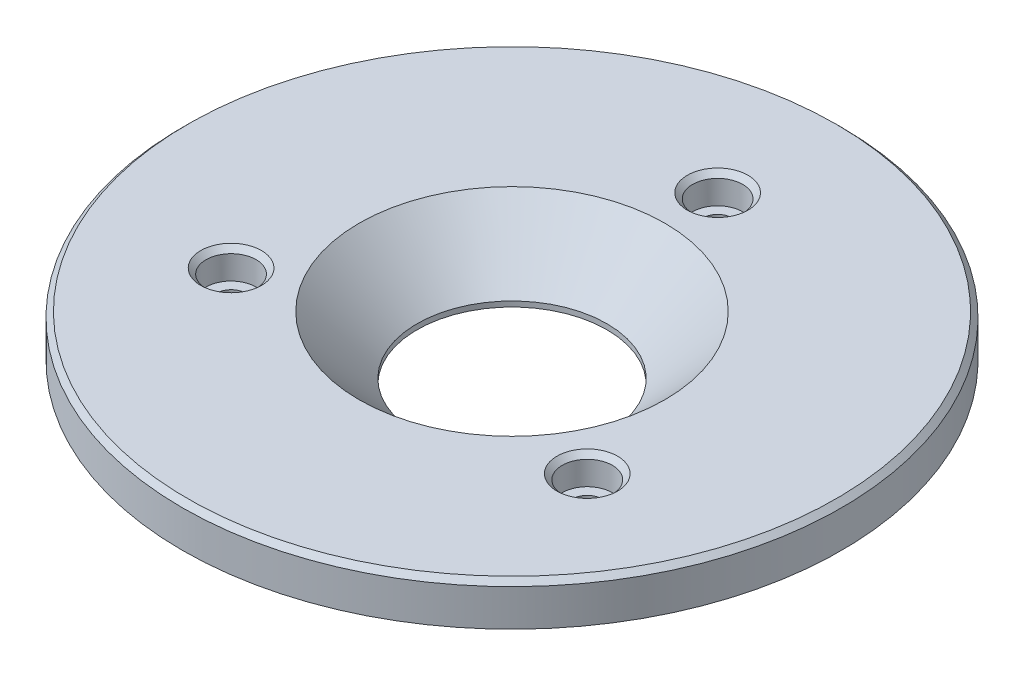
ISO-10303-21;
HEADER;
FILE_DESCRIPTION(('STEP AP214'),'2;1');
FILE_NAME('part.step','',(''),(''),'','','');
FILE_SCHEMA(('AUTOMOTIVE_DESIGN { 1 0 10303 214 1 1 1 1 }'));
ENDSEC;
DATA;
#1=APPLICATION_CONTEXT('core data for automotive mechanical design processes');
#2=APPLICATION_PROTOCOL_DEFINITION('international standard','automotive_design',2000,#1);
#3=PRODUCT_CONTEXT('',#1,'mechanical');
#4=PRODUCT('Part','Part','',(#3));
#5=PRODUCT_RELATED_PRODUCT_CATEGORY('part','',(#4));
#6=PRODUCT_DEFINITION_FORMATION('','',#4);
#7=PRODUCT_DEFINITION_CONTEXT('part definition',#1,'design');
#8=PRODUCT_DEFINITION('design','',#6,#7);
#9=PRODUCT_DEFINITION_SHAPE('','',#8);
#10=(LENGTH_UNIT() NAMED_UNIT(*) SI_UNIT(.MILLI.,.METRE.));
#11=(NAMED_UNIT(*) PLANE_ANGLE_UNIT() SI_UNIT($,.RADIAN.));
#12=(NAMED_UNIT(*) SI_UNIT($,.STERADIAN.) SOLID_ANGLE_UNIT());
#13=UNCERTAINTY_MEASURE_WITH_UNIT(LENGTH_MEASURE(1.E-05),#10,'distance_accuracy_value','');
#14=(GEOMETRIC_REPRESENTATION_CONTEXT(3) GLOBAL_UNCERTAINTY_ASSIGNED_CONTEXT((#13)) GLOBAL_UNIT_ASSIGNED_CONTEXT((#10,
#11,#12)) REPRESENTATION_CONTEXT('',''));
#15=CARTESIAN_POINT('',(0.,0.,0.));
#16=DIRECTION('',(0.,0.,1.));
#17=DIRECTION('',(1.,0.,0.));
#18=AXIS2_PLACEMENT_3D('',#15,#16,#17);
#19=CARTESIAN_POINT('',(-29.,12.,0.));
#20=DIRECTION('',(0.,-1.,0.));
#21=DIRECTION('',(0.,0.,-1.));
#22=AXIS2_PLACEMENT_3D('',#19,#20,#21);
#23=PLANE('',#22);
#24=CARTESIAN_POINT('',(33.7749907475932,12.,19.5));
#25=DIRECTION('',(0.,-1.,0.));
#26=DIRECTION('',(0.,0.,-1.));
#27=AXIS2_PLACEMENT_3D('',#24,#25,#26);
#28=CIRCLE('',#27,5.75);
#29=CARTESIAN_POINT('',(33.7749907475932,12.,13.75));
#30=VERTEX_POINT('',#29);
#31=EDGE_CURVE('E25',#30,#30,#28,.T.);
#32=ORIENTED_EDGE('',*,*,#31,.T.);
#33=EDGE_LOOP('',(#32));
#34=FACE_BOUND('',#33,.T.);
#35=CARTESIAN_POINT('',(0.,12.,-39.));
#36=DIRECTION('',(0.,-1.,0.));
#37=DIRECTION('',(0.,0.,-1.));
#38=AXIS2_PLACEMENT_3D('',#35,#36,#37);
#39=CIRCLE('',#38,5.75);
#40=CARTESIAN_POINT('',(0.,12.,-44.75));
#41=VERTEX_POINT('',#40);
#42=EDGE_CURVE('E29',#41,#41,#39,.T.);
#43=ORIENTED_EDGE('',*,*,#42,.T.);
#44=EDGE_LOOP('',(#43));
#45=FACE_BOUND('',#44,.T.);
#46=CARTESIAN_POINT('',(-33.7749907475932,12.,19.5));
#47=DIRECTION('',(0.,-1.,0.));
#48=DIRECTION('',(0.,0.,-1.));
#49=AXIS2_PLACEMENT_3D('',#46,#47,#48);
#50=CIRCLE('',#49,5.75);
#51=CARTESIAN_POINT('',(-33.7749907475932,12.,13.75));
#52=VERTEX_POINT('',#51);
#53=EDGE_CURVE('E34',#52,#52,#50,.T.);
#54=ORIENTED_EDGE('',*,*,#53,.T.);
#55=EDGE_LOOP('',(#54));
#56=FACE_BOUND('',#55,.T.);
#57=CARTESIAN_POINT('',(0.,12.,0.));
#58=DIRECTION('',(0.,-1.,0.));
#59=DIRECTION('',(0.,0.,-1.));
#60=AXIS2_PLACEMENT_3D('',#57,#58,#59);
#61=CIRCLE('',#60,61.5);
#62=CARTESIAN_POINT('',(0.,12.,-61.5));
#63=VERTEX_POINT('',#62);
#64=EDGE_CURVE('E58',#63,#63,#61,.F.);
#65=ORIENTED_EDGE('',*,*,#64,.T.);
#66=EDGE_LOOP('',(#65));
#67=FACE_BOUND('',#66,.T.);
#68=CARTESIAN_POINT('',(0.,12.,0.));
#69=DIRECTION('',(0.,-1.,0.));
#70=DIRECTION('',(0.,0.,-1.));
#71=AXIS2_PLACEMENT_3D('',#68,#69,#70);
#72=CIRCLE('',#71,29.);
#73=CARTESIAN_POINT('',(0.,12.,-29.));
#74=VERTEX_POINT('',#73);
#75=EDGE_CURVE('E70',#74,#74,#72,.T.);
#76=ORIENTED_EDGE('',*,*,#75,.T.);
#77=EDGE_LOOP('',(#76));
#78=FACE_BOUND('',#77,.T.);
#79=ADVANCED_FACE('F14',(#34,#45,#56,#67,#78),#23,.F.);
#80=CARTESIAN_POINT('',(0.,1.,0.));
#81=DIRECTION('',(0.,1.,0.));
#82=DIRECTION('',(0.,0.,1.));
#83=AXIS2_PLACEMENT_3D('',#80,#81,#82);
#84=CONICAL_SURFACE('',#83,18.,0.78539816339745);
#85=ORIENTED_EDGE('',*,*,#75,.F.);
#86=EDGE_LOOP('',(#85));
#87=FACE_BOUND('',#86,.T.);
#88=CARTESIAN_POINT('',(0.,1.,0.));
#89=DIRECTION('',(0.,-1.,0.));
#90=DIRECTION('',(0.,0.,-1.));
#91=AXIS2_PLACEMENT_3D('',#88,#89,#90);
#92=CIRCLE('',#91,18.);
#93=CARTESIAN_POINT('',(0.,1.,-18.));
#94=VERTEX_POINT('',#93);
#95=EDGE_CURVE('E83',#94,#94,#92,.T.);
#96=ORIENTED_EDGE('',*,*,#95,.T.);
#97=EDGE_LOOP('',(#96));
#98=FACE_BOUND('',#97,.T.);
#99=ADVANCED_FACE('F123',(#87,#98),#84,.F.);
#100=CARTESIAN_POINT('',(0.,0.,0.));
#101=DIRECTION('',(0.,-1.,0.));
#102=DIRECTION('',(0.,0.,-1.));
#103=AXIS2_PLACEMENT_3D('',#100,#101,#102);
#104=CYLINDRICAL_SURFACE('',#103,18.);
#105=ORIENTED_EDGE('',*,*,#95,.F.);
#106=EDGE_LOOP('',(#105));
#107=FACE_BOUND('',#106,.T.);
#108=CARTESIAN_POINT('',(0.,0.,0.));
#109=DIRECTION('',(0.,-1.,0.));
#110=DIRECTION('',(0.,0.,-1.));
#111=AXIS2_PLACEMENT_3D('',#108,#109,#110);
#112=CIRCLE('',#111,18.);
#113=CARTESIAN_POINT('',(0.,0.,-18.));
#114=VERTEX_POINT('',#113);
#115=EDGE_CURVE('E86',#114,#114,#112,.T.);
#116=ORIENTED_EDGE('',*,*,#115,.T.);
#117=EDGE_LOOP('',(#116));
#118=FACE_BOUND('',#117,.T.);
#119=ADVANCED_FACE('F130',(#107,#118),#104,.F.);
#120=CARTESIAN_POINT('',(-18.,0.,0.));
#121=DIRECTION('',(0.,1.,0.));
#122=DIRECTION('',(0.,0.,1.));
#123=AXIS2_PLACEMENT_3D('',#120,#121,#122);
#124=PLANE('',#123);
#125=CARTESIAN_POINT('',(-33.7749907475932,0.,19.5));
#126=DIRECTION('',(0.,1.,0.));
#127=DIRECTION('',(0.,0.,1.));
#128=AXIS2_PLACEMENT_3D('',#125,#126,#127);
#129=CIRCLE('',#128,3.75);
#130=CARTESIAN_POINT('',(-33.7749907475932,0.,23.25));
#131=VERTEX_POINT('',#130);
#132=EDGE_CURVE('E49',#131,#131,#129,.T.);
#133=ORIENTED_EDGE('',*,*,#132,.T.);
#134=EDGE_LOOP('',(#133));
#135=FACE_BOUND('',#134,.T.);
#136=CARTESIAN_POINT('',(33.7749907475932,0.,19.5));
#137=DIRECTION('',(0.,1.,0.));
#138=DIRECTION('',(0.,0.,1.));
#139=AXIS2_PLACEMENT_3D('',#136,#137,#138);
#140=CIRCLE('',#139,3.75);
#141=CARTESIAN_POINT('',(33.7749907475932,0.,23.25));
#142=VERTEX_POINT('',#141);
#143=EDGE_CURVE('E52',#142,#142,#140,.T.);
#144=ORIENTED_EDGE('',*,*,#143,.T.);
#145=EDGE_LOOP('',(#144));
#146=FACE_BOUND('',#145,.T.);
#147=CARTESIAN_POINT('',(0.,0.,-39.));
#148=DIRECTION('',(0.,1.,0.));
#149=DIRECTION('',(0.,0.,1.));
#150=AXIS2_PLACEMENT_3D('',#147,#148,#149);
#151=CIRCLE('',#150,3.75);
#152=CARTESIAN_POINT('',(0.,0.,-35.25));
#153=VERTEX_POINT('',#152);
#154=EDGE_CURVE('E55',#153,#153,#151,.T.);
#155=ORIENTED_EDGE('',*,*,#154,.T.);
#156=EDGE_LOOP('',(#155));
#157=FACE_BOUND('',#156,.T.);
#158=CARTESIAN_POINT('',(0.,0.,0.));
#159=DIRECTION('',(0.,1.,0.));
#160=DIRECTION('',(0.,0.,1.));
#161=AXIS2_PLACEMENT_3D('',#158,#159,#160);
#162=CIRCLE('',#161,44.);
#163=CARTESIAN_POINT('',(0.,0.,44.));
#164=VERTEX_POINT('',#163);
#165=EDGE_CURVE('E67',#164,#164,#162,.F.);
#166=ORIENTED_EDGE('',*,*,#165,.T.);
#167=EDGE_LOOP('',(#166));
#168=FACE_BOUND('',#167,.T.);
#169=ORIENTED_EDGE('',*,*,#115,.F.);
#170=EDGE_LOOP('',(#169));
#171=FACE_BOUND('',#170,.T.);
#172=ADVANCED_FACE('F181',(#135,#146,#157,#168,#171),#124,.F.);
#173=CARTESIAN_POINT('',(0.,0.,0.));
#174=DIRECTION('',(0.,-1.,0.));
#175=DIRECTION('',(0.,0.,-1.));
#176=AXIS2_PLACEMENT_3D('',#173,#174,#175);
#177=CYLINDRICAL_SURFACE('',#176,45.);
#178=CARTESIAN_POINT('',(0.,0.999999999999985,0.));
#179=DIRECTION('',(0.,1.,0.));
#180=DIRECTION('',(0.,0.,1.));
#181=AXIS2_PLACEMENT_3D('',#178,#179,#180);
#182=CIRCLE('',#181,45.);
#183=CARTESIAN_POINT('',(0.,0.999999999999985,45.));
#184=VERTEX_POINT('',#183);
#185=EDGE_CURVE('E64',#184,#184,#182,.T.);
#186=ORIENTED_EDGE('',*,*,#185,.T.);
#187=EDGE_LOOP('',(#186));
#188=FACE_BOUND('',#187,.T.);
#189=CARTESIAN_POINT('',(0.,4.,0.));
#190=DIRECTION('',(0.,-1.,0.));
#191=DIRECTION('',(0.,0.,-1.));
#192=AXIS2_PLACEMENT_3D('',#189,#190,#191);
#193=CIRCLE('',#192,45.);
#194=CARTESIAN_POINT('',(0.,4.,-45.));
#195=VERTEX_POINT('',#194);
#196=EDGE_CURVE('E89',#195,#195,#193,.T.);
#197=ORIENTED_EDGE('',*,*,#196,.T.);
#198=EDGE_LOOP('',(#197));
#199=FACE_BOUND('',#198,.T.);
#200=ADVANCED_FACE('F185',(#188,#199),#177,.T.);
#201=CARTESIAN_POINT('',(-45.,4.,0.));
#202=DIRECTION('',(0.,1.,0.));
#203=DIRECTION('',(0.,0.,1.));
#204=AXIS2_PLACEMENT_3D('',#201,#202,#203);
#205=PLANE('',#204);
#206=ORIENTED_EDGE('',*,*,#196,.F.);
#207=EDGE_LOOP('',(#206));
#208=FACE_BOUND('',#207,.T.);
#209=CARTESIAN_POINT('',(0.,4.,0.));
#210=DIRECTION('',(0.,-1.,0.));
#211=DIRECTION('',(0.,0.,-1.));
#212=AXIS2_PLACEMENT_3D('',#209,#210,#211);
#213=CIRCLE('',#212,62.5);
#214=CARTESIAN_POINT('',(0.,4.,-62.5));
#215=VERTEX_POINT('',#214);
#216=EDGE_CURVE('E92',#215,#215,#213,.T.);
#217=ORIENTED_EDGE('',*,*,#216,.T.);
#218=EDGE_LOOP('',(#217));
#219=FACE_BOUND('',#218,.T.);
#220=ADVANCED_FACE('F192',(#208,#219),#205,.F.);
#221=CARTESIAN_POINT('',(0.,0.,0.));
#222=DIRECTION('',(0.,-1.,0.));
#223=DIRECTION('',(0.,0.,-1.));
#224=AXIS2_PLACEMENT_3D('',#221,#222,#223);
#225=CYLINDRICAL_SURFACE('',#224,62.5);
#226=CARTESIAN_POINT('',(0.,11.,0.));
#227=DIRECTION('',(0.,-1.,0.));
#228=DIRECTION('',(0.,0.,-1.));
#229=AXIS2_PLACEMENT_3D('',#226,#227,#228);
#230=CIRCLE('',#229,62.5);
#231=CARTESIAN_POINT('',(0.,11.,-62.5));
#232=VERTEX_POINT('',#231);
#233=EDGE_CURVE('E61',#232,#232,#230,.T.);
#234=ORIENTED_EDGE('',*,*,#233,.T.);
#235=EDGE_LOOP('',(#234));
#236=FACE_BOUND('',#235,.T.);
#237=ORIENTED_EDGE('',*,*,#216,.F.);
#238=EDGE_LOOP('',(#237));
#239=FACE_BOUND('',#238,.T.);
#240=ADVANCED_FACE('F199',(#236,#239),#225,.T.);
#241=CARTESIAN_POINT('',(33.7749907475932,6.5,19.5));
#242=DIRECTION('',(0.,1.,0.));
#243=DIRECTION('',(0.,0.,1.));
#244=AXIS2_PLACEMENT_3D('',#241,#242,#243);
#245=CYLINDRICAL_SURFACE('',#244,4.75);
#246=CARTESIAN_POINT('',(33.7749907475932,11.,19.5));
#247=DIRECTION('',(0.,-1.,0.));
#248=DIRECTION('',(0.,0.,-1.));
#249=AXIS2_PLACEMENT_3D('',#246,#247,#248);
#250=CIRCLE('',#249,4.75);
#251=CARTESIAN_POINT('',(33.7749907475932,11.,14.75));
#252=VERTEX_POINT('',#251);
#253=EDGE_CURVE('E37',#252,#252,#250,.F.);
#254=ORIENTED_EDGE('',*,*,#253,.T.);
#255=EDGE_LOOP('',(#254));
#256=FACE_BOUND('',#255,.T.);
#257=CARTESIAN_POINT('',(33.7749907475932,6.5,19.5));
#258=DIRECTION('',(0.,1.,0.));
#259=DIRECTION('',(0.,0.,-1.));
#260=AXIS2_PLACEMENT_3D('',#257,#258,#259);
#261=CIRCLE('',#260,4.75);
#262=CARTESIAN_POINT('',(33.7749907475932,6.5,14.75));
#263=VERTEX_POINT('',#262);
#264=EDGE_CURVE('E74',#263,#263,#261,.T.);
#265=ORIENTED_EDGE('',*,*,#264,.F.);
#266=EDGE_LOOP('',(#265));
#267=FACE_BOUND('',#266,.T.);
#268=ADVANCED_FACE('F203',(#256,#267),#245,.F.);
#269=CARTESIAN_POINT('',(33.7749907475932,6.5,19.5));
#270=DIRECTION('',(0.,-1.,0.));
#271=DIRECTION('',(0.,0.,-1.));
#272=AXIS2_PLACEMENT_3D('',#269,#270,#271);
#273=PLANE('',#272);
#274=CARTESIAN_POINT('',(33.7749907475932,6.5,19.5));
#275=DIRECTION('',(0.,-1.,0.));
#276=DIRECTION('',(0.,0.,-1.));
#277=AXIS2_PLACEMENT_3D('',#274,#275,#276);
#278=CIRCLE('',#277,2.75);
#279=CARTESIAN_POINT('',(33.7749907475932,6.5,16.75));
#280=VERTEX_POINT('',#279);
#281=EDGE_CURVE('E71',#280,#280,#278,.T.);
#282=ORIENTED_EDGE('',*,*,#281,.T.);
#283=EDGE_LOOP('',(#282));
#284=FACE_BOUND('',#283,.T.);
#285=ORIENTED_EDGE('',*,*,#264,.T.);
#286=EDGE_LOOP('',(#285));
#287=FACE_BOUND('',#286,.T.);
#288=ADVANCED_FACE('F207',(#284,#287),#273,.F.);
#289=CARTESIAN_POINT('',(-33.7749907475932,6.5,19.5));
#290=DIRECTION('',(0.,1.,0.));
#291=DIRECTION('',(0.,0.,1.));
#292=AXIS2_PLACEMENT_3D('',#289,#290,#291);
#293=CYLINDRICAL_SURFACE('',#292,4.75);
#294=CARTESIAN_POINT('',(-33.7749907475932,11.,19.5));
#295=DIRECTION('',(0.,-1.,0.));
#296=DIRECTION('',(0.,0.,-1.));
#297=AXIS2_PLACEMENT_3D('',#294,#295,#296);
#298=CIRCLE('',#297,4.75);
#299=CARTESIAN_POINT('',(-33.7749907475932,11.,14.75));
#300=VERTEX_POINT('',#299);
#301=EDGE_CURVE('E9',#300,#300,#298,.F.);
#302=ORIENTED_EDGE('',*,*,#301,.T.);
#303=EDGE_LOOP('',(#302));
#304=FACE_BOUND('',#303,.T.);
#305=CARTESIAN_POINT('',(-33.7749907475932,6.5,19.5));
#306=DIRECTION('',(0.,1.,0.));
#307=DIRECTION('',(0.,0.,1.));
#308=AXIS2_PLACEMENT_3D('',#305,#306,#307);
#309=CIRCLE('',#308,4.75);
#310=CARTESIAN_POINT('',(-33.7749907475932,6.5,24.25));
#311=VERTEX_POINT('',#310);
#312=EDGE_CURVE('E98',#311,#311,#309,.T.);
#313=ORIENTED_EDGE('',*,*,#312,.F.);
#314=EDGE_LOOP('',(#313));
#315=FACE_BOUND('',#314,.T.);
#316=ADVANCED_FACE('F119',(#304,#315),#293,.F.);
#317=CARTESIAN_POINT('',(-33.7749907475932,6.5,19.5));
#318=DIRECTION('',(0.,1.,0.));
#319=DIRECTION('',(0.,0.,1.));
#320=AXIS2_PLACEMENT_3D('',#317,#318,#319);
#321=PLANE('',#320);
#322=CARTESIAN_POINT('',(-33.7749907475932,6.5,19.5));
#323=DIRECTION('',(0.,1.,0.));
#324=DIRECTION('',(0.,0.,1.));
#325=AXIS2_PLACEMENT_3D('',#322,#323,#324);
#326=CIRCLE('',#325,2.75);
#327=CARTESIAN_POINT('',(-33.7749907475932,6.5,22.25));
#328=VERTEX_POINT('',#327);
#329=EDGE_CURVE('E75',#328,#328,#326,.T.);
#330=ORIENTED_EDGE('',*,*,#329,.F.);
#331=EDGE_LOOP('',(#330));
#332=FACE_BOUND('',#331,.T.);
#333=ORIENTED_EDGE('',*,*,#312,.T.);
#334=EDGE_LOOP('',(#333));
#335=FACE_BOUND('',#334,.T.);
#336=ADVANCED_FACE('F108',(#332,#335),#321,.T.);
#337=CARTESIAN_POINT('',(0.,6.5,-39.));
#338=DIRECTION('',(0.,1.,0.));
#339=DIRECTION('',(0.,0.,1.));
#340=AXIS2_PLACEMENT_3D('',#337,#338,#339);
#341=CYLINDRICAL_SURFACE('',#340,4.75);
#342=CARTESIAN_POINT('',(0.,11.,-39.));
#343=DIRECTION('',(0.,-1.,0.));
#344=DIRECTION('',(0.,0.,-1.));
#345=AXIS2_PLACEMENT_3D('',#342,#343,#344);
#346=CIRCLE('',#345,4.75);
#347=CARTESIAN_POINT('',(0.,11.,-43.75));
#348=VERTEX_POINT('',#347);
#349=EDGE_CURVE('E21',#348,#348,#346,.F.);
#350=ORIENTED_EDGE('',*,*,#349,.T.);
#351=EDGE_LOOP('',(#350));
#352=FACE_BOUND('',#351,.T.);
#353=CARTESIAN_POINT('',(0.,6.5,-39.));
#354=DIRECTION('',(0.,1.,0.));
#355=DIRECTION('',(0.,0.,1.));
#356=AXIS2_PLACEMENT_3D('',#353,#354,#355);
#357=CIRCLE('',#356,4.75);
#358=CARTESIAN_POINT('',(0.,6.5,-34.25));
#359=VERTEX_POINT('',#358);
#360=EDGE_CURVE('E95',#359,#359,#357,.T.);
#361=ORIENTED_EDGE('',*,*,#360,.F.);
#362=EDGE_LOOP('',(#361));
#363=FACE_BOUND('',#362,.T.);
#364=ADVANCED_FACE('F106',(#352,#363),#341,.F.);
#365=CARTESIAN_POINT('',(0.,6.5,-39.));
#366=DIRECTION('',(0.,1.,0.));
#367=DIRECTION('',(0.,0.,1.));
#368=AXIS2_PLACEMENT_3D('',#365,#366,#367);
#369=PLANE('',#368);
#370=CARTESIAN_POINT('',(0.,6.5,-39.));
#371=DIRECTION('',(0.,1.,0.));
#372=DIRECTION('',(0.,0.,1.));
#373=AXIS2_PLACEMENT_3D('',#370,#371,#372);
#374=CIRCLE('',#373,2.75);
#375=CARTESIAN_POINT('',(0.,6.5,-36.25));
#376=VERTEX_POINT('',#375);
#377=EDGE_CURVE('E78',#376,#376,#374,.T.);
#378=ORIENTED_EDGE('',*,*,#377,.F.);
#379=EDGE_LOOP('',(#378));
#380=FACE_BOUND('',#379,.T.);
#381=ORIENTED_EDGE('',*,*,#360,.T.);
#382=EDGE_LOOP('',(#381));
#383=FACE_BOUND('',#382,.T.);
#384=ADVANCED_FACE('F104',(#380,#383),#369,.T.);
#385=CARTESIAN_POINT('',(0.,0.,-39.));
#386=DIRECTION('',(0.,1.,0.));
#387=DIRECTION('',(0.,0.,1.));
#388=AXIS2_PLACEMENT_3D('',#385,#386,#387);
#389=CYLINDRICAL_SURFACE('',#388,2.75);
#390=CARTESIAN_POINT('',(0.,1.00000000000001,-39.));
#391=DIRECTION('',(0.,1.,0.));
#392=DIRECTION('',(0.,0.,1.));
#393=AXIS2_PLACEMENT_3D('',#390,#391,#392);
#394=CIRCLE('',#393,2.75);
#395=CARTESIAN_POINT('',(0.,1.00000000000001,-36.25));
#396=VERTEX_POINT('',#395);
#397=EDGE_CURVE('E40',#396,#396,#394,.F.);
#398=ORIENTED_EDGE('',*,*,#397,.T.);
#399=EDGE_LOOP('',(#398));
#400=FACE_BOUND('',#399,.T.);
#401=ORIENTED_EDGE('',*,*,#377,.T.);
#402=EDGE_LOOP('',(#401));
#403=FACE_BOUND('',#402,.T.);
#404=ADVANCED_FACE('F116',(#400,#403),#389,.F.);
#405=CARTESIAN_POINT('',(-33.7749907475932,0.,19.5));
#406=DIRECTION('',(0.,1.,0.));
#407=DIRECTION('',(0.,0.,1.));
#408=AXIS2_PLACEMENT_3D('',#405,#406,#407);
#409=CYLINDRICAL_SURFACE('',#408,2.75);
#410=CARTESIAN_POINT('',(-33.7749907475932,0.999999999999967,19.5));
#411=DIRECTION('',(0.,1.,0.));
#412=DIRECTION('',(0.,0.,1.));
#413=AXIS2_PLACEMENT_3D('',#410,#411,#412);
#414=CIRCLE('',#413,2.75);
#415=CARTESIAN_POINT('',(-33.7749907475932,0.999999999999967,22.25));
#416=VERTEX_POINT('',#415);
#417=EDGE_CURVE('E46',#416,#416,#414,.F.);
#418=ORIENTED_EDGE('',*,*,#417,.T.);
#419=EDGE_LOOP('',(#418));
#420=FACE_BOUND('',#419,.T.);
#421=ORIENTED_EDGE('',*,*,#329,.T.);
#422=EDGE_LOOP('',(#421));
#423=FACE_BOUND('',#422,.T.);
#424=ADVANCED_FACE('F338',(#420,#423),#409,.F.);
#425=CARTESIAN_POINT('',(33.7749907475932,0.,19.5));
#426=DIRECTION('',(0.,1.,0.));
#427=DIRECTION('',(0.,0.,1.));
#428=AXIS2_PLACEMENT_3D('',#425,#426,#427);
#429=CYLINDRICAL_SURFACE('',#428,2.75);
#430=CARTESIAN_POINT('',(33.7749907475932,1.,19.5));
#431=DIRECTION('',(0.,1.,0.));
#432=DIRECTION('',(0.,0.,1.));
#433=AXIS2_PLACEMENT_3D('',#430,#431,#432);
#434=CIRCLE('',#433,2.75);
#435=CARTESIAN_POINT('',(33.7749907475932,1.,22.25));
#436=VERTEX_POINT('',#435);
#437=EDGE_CURVE('E43',#436,#436,#434,.F.);
#438=ORIENTED_EDGE('',*,*,#437,.T.);
#439=EDGE_LOOP('',(#438));
#440=FACE_BOUND('',#439,.T.);
#441=ORIENTED_EDGE('',*,*,#281,.F.);
#442=EDGE_LOOP('',(#441));
#443=FACE_BOUND('',#442,.T.);
#444=ADVANCED_FACE('F140',(#440,#443),#429,.F.);
#445=CARTESIAN_POINT('',(0.,0.,0.));
#446=DIRECTION('',(0.,1.,0.));
#447=DIRECTION('',(0.,0.,1.));
#448=AXIS2_PLACEMENT_3D('',#445,#446,#447);
#449=CONICAL_SURFACE('',#448,44.,0.785398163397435);
#450=ORIENTED_EDGE('',*,*,#185,.F.);
#451=EDGE_LOOP('',(#450));
#452=FACE_BOUND('',#451,.T.);
#453=ORIENTED_EDGE('',*,*,#165,.F.);
#454=EDGE_LOOP('',(#453));
#455=FACE_BOUND('',#454,.T.);
#456=ADVANCED_FACE('F136',(#452,#455),#449,.T.);
#457=CARTESIAN_POINT('',(0.,11.,0.));
#458=DIRECTION('',(0.,-1.,0.));
#459=DIRECTION('',(0.,0.,-1.));
#460=AXIS2_PLACEMENT_3D('',#457,#458,#459);
#461=CONICAL_SURFACE('',#460,62.5,0.785398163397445);
#462=ORIENTED_EDGE('',*,*,#64,.F.);
#463=EDGE_LOOP('',(#462));
#464=FACE_BOUND('',#463,.T.);
#465=ORIENTED_EDGE('',*,*,#233,.F.);
#466=EDGE_LOOP('',(#465));
#467=FACE_BOUND('',#466,.T.);
#468=ADVANCED_FACE('F139',(#464,#467),#461,.T.);
#469=CARTESIAN_POINT('',(-33.7749907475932,0.,19.5));
#470=DIRECTION('',(0.,-1.,0.));
#471=DIRECTION('',(0.,0.,-1.));
#472=AXIS2_PLACEMENT_3D('',#469,#470,#471);
#473=CONICAL_SURFACE('',#472,3.75,0.785398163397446);
#474=ORIENTED_EDGE('',*,*,#417,.F.);
#475=EDGE_LOOP('',(#474));
#476=FACE_BOUND('',#475,.T.);
#477=ORIENTED_EDGE('',*,*,#132,.F.);
#478=EDGE_LOOP('',(#477));
#479=FACE_BOUND('',#478,.T.);
#480=ADVANCED_FACE('F144',(#476,#479),#473,.F.);
#481=CARTESIAN_POINT('',(33.7749907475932,0.,19.5));
#482=DIRECTION('',(0.,-1.,0.));
#483=DIRECTION('',(0.,0.,-1.));
#484=AXIS2_PLACEMENT_3D('',#481,#482,#483);
#485=CONICAL_SURFACE('',#484,3.75,0.785398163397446);
#486=ORIENTED_EDGE('',*,*,#437,.F.);
#487=EDGE_LOOP('',(#486));
#488=FACE_BOUND('',#487,.T.);
#489=ORIENTED_EDGE('',*,*,#143,.F.);
#490=EDGE_LOOP('',(#489));
#491=FACE_BOUND('',#490,.T.);
#492=ADVANCED_FACE('F148',(#488,#491),#485,.F.);
#493=CARTESIAN_POINT('',(0.,0.,-39.));
#494=DIRECTION('',(0.,-1.,0.));
#495=DIRECTION('',(0.,0.,-1.));
#496=AXIS2_PLACEMENT_3D('',#493,#494,#495);
#497=CONICAL_SURFACE('',#496,3.75,0.785398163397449);
#498=ORIENTED_EDGE('',*,*,#397,.F.);
#499=EDGE_LOOP('',(#498));
#500=FACE_BOUND('',#499,.T.);
#501=ORIENTED_EDGE('',*,*,#154,.F.);
#502=EDGE_LOOP('',(#501));
#503=FACE_BOUND('',#502,.T.);
#504=ADVANCED_FACE('F152',(#500,#503),#497,.F.);
#505=CARTESIAN_POINT('',(33.7749907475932,11.,19.5));
#506=DIRECTION('',(0.,1.,0.));
#507=DIRECTION('',(0.,0.,1.));
#508=AXIS2_PLACEMENT_3D('',#505,#506,#507);
#509=CONICAL_SURFACE('',#508,4.75,0.785398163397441);
#510=ORIENTED_EDGE('',*,*,#31,.F.);
#511=EDGE_LOOP('',(#510));
#512=FACE_BOUND('',#511,.T.);
#513=ORIENTED_EDGE('',*,*,#253,.F.);
#514=EDGE_LOOP('',(#513));
#515=FACE_BOUND('',#514,.T.);
#516=ADVANCED_FACE('F156',(#512,#515),#509,.F.);
#517=CARTESIAN_POINT('',(0.,11.,-39.));
#518=DIRECTION('',(0.,1.,0.));
#519=DIRECTION('',(0.,0.,1.));
#520=AXIS2_PLACEMENT_3D('',#517,#518,#519);
#521=CONICAL_SURFACE('',#520,4.75,0.785398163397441);
#522=ORIENTED_EDGE('',*,*,#42,.F.);
#523=EDGE_LOOP('',(#522));
#524=FACE_BOUND('',#523,.T.);
#525=ORIENTED_EDGE('',*,*,#349,.F.);
#526=EDGE_LOOP('',(#525));
#527=FACE_BOUND('',#526,.T.);
#528=ADVANCED_FACE('F159',(#524,#527),#521,.F.);
#529=CARTESIAN_POINT('',(-33.7749907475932,11.,19.5));
#530=DIRECTION('',(0.,1.,0.));
#531=DIRECTION('',(0.,0.,1.));
#532=AXIS2_PLACEMENT_3D('',#529,#530,#531);
#533=CONICAL_SURFACE('',#532,4.75,0.785398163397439);
#534=ORIENTED_EDGE('',*,*,#53,.F.);
#535=EDGE_LOOP('',(#534));
#536=FACE_BOUND('',#535,.T.);
#537=ORIENTED_EDGE('',*,*,#301,.F.);
#538=EDGE_LOOP('',(#537));
#539=FACE_BOUND('',#538,.T.);
#540=ADVANCED_FACE('F16',(#536,#539),#533,.F.);
#541=CLOSED_SHELL('',(#79,#99,#119,#172,#200,#220,#240,#268,#288,#316,#336,#364,#384,#404,#424,
#444,#456,#468,#480,#492,#504,#516,#528,#540));
#542=MANIFOLD_SOLID_BREP('B1',#541);
#543=ADVANCED_BREP_SHAPE_REPRESENTATION('',(#18,#542),#14);
#544=SHAPE_DEFINITION_REPRESENTATION(#9,#543);
ENDSEC;
END-ISO-10303-21;
